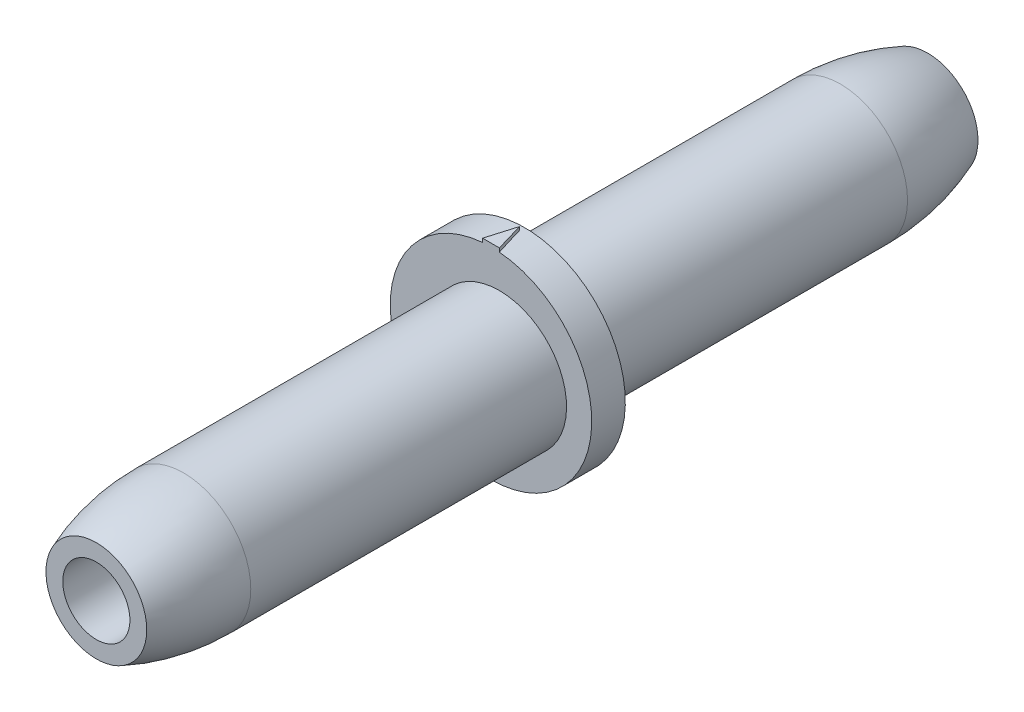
ISO-10303-21;
HEADER;
FILE_DESCRIPTION(('STEP AP214'),'2;1');
FILE_NAME('part.step','',(''),(''),'','','');
FILE_SCHEMA(('AUTOMOTIVE_DESIGN { 1 0 10303 214 1 1 1 1 }'));
ENDSEC;
DATA;
#1=APPLICATION_CONTEXT('core data for automotive mechanical design processes');
#2=APPLICATION_PROTOCOL_DEFINITION('international standard','automotive_design',2000,#1);
#3=PRODUCT_CONTEXT('',#1,'mechanical');
#4=PRODUCT('Part','Part','',(#3));
#5=PRODUCT_RELATED_PRODUCT_CATEGORY('part','',(#4));
#6=PRODUCT_DEFINITION_FORMATION('','',#4);
#7=PRODUCT_DEFINITION_CONTEXT('part definition',#1,'design');
#8=PRODUCT_DEFINITION('design','',#6,#7);
#9=PRODUCT_DEFINITION_SHAPE('','',#8);
#10=(LENGTH_UNIT() NAMED_UNIT(*) SI_UNIT(.MILLI.,.METRE.));
#11=(NAMED_UNIT(*) PLANE_ANGLE_UNIT() SI_UNIT($,.RADIAN.));
#12=(NAMED_UNIT(*) SI_UNIT($,.STERADIAN.) SOLID_ANGLE_UNIT());
#13=UNCERTAINTY_MEASURE_WITH_UNIT(LENGTH_MEASURE(1.E-05),#10,'distance_accuracy_value','');
#14=(GEOMETRIC_REPRESENTATION_CONTEXT(3) GLOBAL_UNCERTAINTY_ASSIGNED_CONTEXT((#13)) GLOBAL_UNIT_ASSIGNED_CONTEXT((#10,
#11,#12)) REPRESENTATION_CONTEXT('',''));
#15=CARTESIAN_POINT('',(0.,0.,0.));
#16=DIRECTION('',(0.,0.,1.));
#17=DIRECTION('',(1.,0.,0.));
#18=AXIS2_PLACEMENT_3D('',#15,#16,#17);
#19=CARTESIAN_POINT('',(8.29346026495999,3.0184723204,2.000000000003));
#20=DIRECTION('',(0.,3.58370213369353E-13,-1.));
#21=DIRECTION('',(-0.422618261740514,-0.906307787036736,-3.20665975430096E-13));
#22=AXIS2_PLACEMENT_3D('',#19,#20,#21);
#23=PLANE('',#22);
#24=CARTESIAN_POINT('',(0.5,0.,2.00000000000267));
#25=DIRECTION('',(0.,0.,-1.));
#26=DIRECTION('',(0.,1.,0.));
#27=AXIS2_PLACEMENT_3D('',#24,#25,#26);
#28=CIRCLE('',#27,2.);
#29=CARTESIAN_POINT('',(0.5,2.00000000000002,2.00000000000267));
#30=VERTEX_POINT('',#29);
#31=EDGE_CURVE('E18',#30,#30,#28,.T.);
#32=ORIENTED_EDGE('',*,*,#31,.F.);
#33=EDGE_LOOP('',(#32));
#34=FACE_BOUND('',#33,.T.);
#35=ADVANCED_FACE('F14',(#34),#23,.F.);
#36=CARTESIAN_POINT('',(0.5,0.,25.9999999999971));
#37=DIRECTION('',(0.,0.,-1.));
#38=DIRECTION('',(0.,1.,0.));
#39=AXIS2_PLACEMENT_3D('',#36,#37,#38);
#40=CYLINDRICAL_SURFACE('',#39,2.);
#41=CARTESIAN_POINT('',(0.5,0.,25.9999999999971));
#42=DIRECTION('',(0.,0.,-1.));
#43=DIRECTION('',(0.,1.,0.));
#44=AXIS2_PLACEMENT_3D('',#41,#42,#43);
#45=CIRCLE('',#44,2.);
#46=CARTESIAN_POINT('',(0.5,1.99999999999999,25.9999999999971));
#47=VERTEX_POINT('',#46);
#48=EDGE_CURVE('E102',#47,#47,#45,.T.);
#49=ORIENTED_EDGE('',*,*,#48,.F.);
#50=EDGE_LOOP('',(#49));
#51=FACE_BOUND('',#50,.T.);
#52=ORIENTED_EDGE('',*,*,#31,.T.);
#53=EDGE_LOOP('',(#52));
#54=FACE_BOUND('',#53,.T.);
#55=ADVANCED_FACE('F124',(#51,#54),#40,.F.);
#56=CARTESIAN_POINT('',(-2.62,3.12494455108,25.999999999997));
#57=DIRECTION('',(0.,0.,1.));
#58=DIRECTION('',(0.,-1.,0.));
#59=AXIS2_PLACEMENT_3D('',#56,#57,#58);
#60=PLANE('',#59);
#61=ORIENTED_EDGE('',*,*,#48,.T.);
#62=EDGE_LOOP('',(#61));
#63=FACE_BOUND('',#62,.T.);
#64=CARTESIAN_POINT('',(0.5,0.,25.999999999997));
#65=DIRECTION('',(0.,0.,-1.));
#66=DIRECTION('',(0.,1.,0.));
#67=AXIS2_PLACEMENT_3D('',#64,#65,#66);
#68=CIRCLE('',#67,3.00000000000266);
#69=CARTESIAN_POINT('',(0.5,3.00000000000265,25.999999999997));
#70=VERTEX_POINT('',#69);
#71=EDGE_CURVE('E100',#70,#70,#68,.F.);
#72=ORIENTED_EDGE('',*,*,#71,.T.);
#73=EDGE_LOOP('',(#72));
#74=FACE_BOUND('',#73,.T.);
#75=ADVANCED_FACE('F122',(#63,#74),#60,.T.);
#76=CARTESIAN_POINT('',(-9.5,0.,20.803847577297));
#77=DIRECTION('',(0.,1.,0.));
#78=DIRECTION('',(0.925721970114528,0.,0.378204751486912));
#79=AXIS2_PLACEMENT_3D('',#76,#77,#78);
#80=CIRCLE('',#79,14.);
#81=TRIMMED_CURVE('',#80,(PARAMETER_VALUE(-0.387337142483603)),
(PARAMETER_VALUE(1.16304960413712)),.T.,.PARAMETER.);
#82=CARTESIAN_POINT('',(0.5,0.,20.803847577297));
#83=DIRECTION('',(0.,0.,-1.));
#84=AXIS1_PLACEMENT('',#82,#83);
#85=SURFACE_OF_REVOLUTION('',#81,#84);
#86=ORIENTED_EDGE('',*,*,#71,.F.);
#87=EDGE_LOOP('',(#86));
#88=FACE_BOUND('',#87,.T.);
#89=CARTESIAN_POINT('',(0.5,0.,20.8038475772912));
#90=DIRECTION('',(0.,0.,-1.));
#91=DIRECTION('',(1.,0.,0.));
#92=AXIS2_PLACEMENT_3D('',#89,#90,#91);
#93=CIRCLE('',#92,4.);
#94=CARTESIAN_POINT('',(4.5,0.,20.8038475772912));
#95=VERTEX_POINT('',#94);
#96=EDGE_CURVE('E61',#95,#95,#93,.F.);
#97=ORIENTED_EDGE('',*,*,#96,.T.);
#98=EDGE_LOOP('',(#97));
#99=FACE_BOUND('',#98,.T.);
#100=ADVANCED_FACE('F118',(#88,#99),#85,.T.);
#101=CARTESIAN_POINT('',(0.523832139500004,6.20000000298,2.248109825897));
#102=DIRECTION('',(0.,1.,0.));
#103=DIRECTION('',(0.173648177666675,0.,-0.984807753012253));
#104=AXIS2_PLACEMENT_3D('',#101,#102,#103);
#105=PLANE('',#104);
#106=DIRECTION('',(0.28216631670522,0.,0.959365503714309));
#107=VECTOR('',#106,1.);
#108=CARTESIAN_POINT('',(0.25,6.20000000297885,1.1499999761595));
#109=LINE('',#108,#107);
#110=CARTESIAN_POINT('',(-6.03683769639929E-13,6.20000000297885,0.299999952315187));
#111=VERTEX_POINT('',#110);
#112=CARTESIAN_POINT('',(0.4999999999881,6.20000000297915,1.99999999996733));
#113=VERTEX_POINT('',#112);
#114=EDGE_CURVE('E52',#111,#113,#109,.T.);
#115=ORIENTED_EDGE('',*,*,#114,.F.);
#116=DIRECTION('',(-0.282166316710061,0.,0.959365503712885));
#117=VECTOR('',#116,1.);
#118=CARTESIAN_POINT('',(-0.250000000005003,6.20000000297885,1.1499999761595));
#119=LINE('',#118,#117);
#120=CARTESIAN_POINT('',(-0.500000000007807,6.20000000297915,2.00000000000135));
#121=VERTEX_POINT('',#120);
#122=EDGE_CURVE('E56',#111,#121,#119,.T.);
#123=ORIENTED_EDGE('',*,*,#122,.T.);
#124=DIRECTION('',(1.,0.,-3.24393290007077E-13));
#125=VECTOR('',#124,1.);
#126=CARTESIAN_POINT('',(-0.500000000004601,6.20000000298,1.9999999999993));
#127=LINE('',#126,#125);
#128=EDGE_CURVE('E46',#121,#113,#127,.T.);
#129=ORIENTED_EDGE('',*,*,#128,.T.);
#130=EDGE_LOOP('',(#115,#123,#129));
#131=FACE_BOUND('',#130,.T.);
#132=ADVANCED_FACE('F54',(#131),#105,.T.);
#133=CARTESIAN_POINT('',(0.5,0.,20.8038475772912));
#134=DIRECTION('',(0.,0.,-1.));
#135=DIRECTION('',(0.,1.,0.));
#136=AXIS2_PLACEMENT_3D('',#133,#134,#135);
#137=CYLINDRICAL_SURFACE('',#136,4.);
#138=ORIENTED_EDGE('',*,*,#96,.F.);
#139=EDGE_LOOP('',(#138));
#140=FACE_BOUND('',#139,.T.);
#141=CARTESIAN_POINT('',(0.5,0.,2.00000000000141));
#142=DIRECTION('',(0.,0.,-1.));
#143=DIRECTION('',(0.,1.,0.));
#144=AXIS2_PLACEMENT_3D('',#141,#142,#143);
#145=CIRCLE('',#144,4.);
#146=CARTESIAN_POINT('',(0.5,4.,2.00000000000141));
#147=VERTEX_POINT('',#146);
#148=EDGE_CURVE('E95',#147,#147,#145,.F.);
#149=ORIENTED_EDGE('',*,*,#148,.T.);
#150=EDGE_LOOP('',(#149));
#151=FACE_BOUND('',#150,.T.);
#152=ADVANCED_FACE('F125',(#140,#151),#137,.T.);
#153=CARTESIAN_POINT('',(0.518779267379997,6.26655389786,2.063849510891));
#154=DIRECTION('',(0.959365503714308,0.,-0.282166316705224));
#155=DIRECTION('',(0.,-1.,0.));
#156=AXIS2_PLACEMENT_3D('',#153,#154,#155);
#157=PLANE('',#156);
#158=ORIENTED_EDGE('',*,*,#114,.T.);
#159=DIRECTION('',(0.,-1.,0.));
#160=VECTOR('',#159,1.);
#161=CARTESIAN_POINT('',(0.499999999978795,6.26655389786,1.99999999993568));
#162=LINE('',#161,#160);
#163=CARTESIAN_POINT('',(0.499999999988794,5.9791471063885,1.99999999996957));
#164=VERTEX_POINT('',#163);
#165=EDGE_CURVE('E71',#113,#164,#162,.T.);
#166=ORIENTED_EDGE('',*,*,#165,.T.);
#167=CARTESIAN_POINT('',(0.000100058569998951,7.76058300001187E-05,0.30034015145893));
#168=DIRECTION('',(0.959365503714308,0.,-0.282166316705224));
#169=DIRECTION('',(0.282166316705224,0.,0.959365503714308));
#170=AXIS2_PLACEMENT_3D('',#167,#168,#169);
#171=ELLIPSE('',#170,21.2638102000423,5.99993100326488);
#172=CARTESIAN_POINT('',(-8.04911692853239E-13,6.00000860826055,0.299999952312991));
#173=VERTEX_POINT('',#172);
#174=EDGE_CURVE('E65',#164,#173,#171,.F.);
#175=ORIENTED_EDGE('',*,*,#174,.T.);
#176=DIRECTION('',(0.,1.,0.));
#177=VECTOR('',#176,1.);
#178=CARTESIAN_POINT('',(-1.50573997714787E-12,6.089565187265,0.299999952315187));
#179=LINE('',#178,#177);
#180=EDGE_CURVE('E60',#173,#111,#179,.T.);
#181=ORIENTED_EDGE('',*,*,#180,.T.);
#182=EDGE_LOOP('',(#158,#166,#175,#181));
#183=FACE_BOUND('',#182,.T.);
#184=ADVANCED_FACE('F64',(#183),#157,.T.);
#185=CARTESIAN_POINT('',(0.0187792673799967,5.91257647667,0.236150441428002));
#186=DIRECTION('',(0.959365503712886,0.,0.282166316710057));
#187=DIRECTION('',(0.,1.,0.));
#188=AXIS2_PLACEMENT_3D('',#185,#186,#187);
#189=PLANE('',#188);
#190=ORIENTED_EDGE('',*,*,#122,.F.);
#191=ORIENTED_EDGE('',*,*,#180,.F.);
#192=CARTESIAN_POINT('',(0.000100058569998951,7.76058300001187E-05,0.299659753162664));
#193=DIRECTION('',(0.959365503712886,0.,0.282166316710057));
#194=DIRECTION('',(-0.282166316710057,0.,0.959365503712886));
#195=AXIS2_PLACEMENT_3D('',#192,#193,#194);
#196=ELLIPSE('',#195,21.2638101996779,5.99993100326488);
#197=CARTESIAN_POINT('',(-0.500000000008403,5.9791303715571,2.00000000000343));
#198=VERTEX_POINT('',#197);
#199=EDGE_CURVE('E89',#173,#198,#196,.T.);
#200=ORIENTED_EDGE('',*,*,#199,.T.);
#201=DIRECTION('',(0.,1.,0.));
#202=VECTOR('',#201,1.);
#203=CARTESIAN_POINT('',(-0.500000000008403,5.91257647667,2.0000000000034));
#204=LINE('',#203,#202);
#205=EDGE_CURVE('E69',#198,#121,#204,.T.);
#206=ORIENTED_EDGE('',*,*,#205,.T.);
#207=EDGE_LOOP('',(#190,#191,#200,#206));
#208=FACE_BOUND('',#207,.T.);
#209=ADVANCED_FACE('F68',(#208),#189,.F.);
#210=CARTESIAN_POINT('',(8.29346026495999,3.0184723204,2.000000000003));
#211=DIRECTION('',(0.,3.58370213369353E-13,-1.));
#212=DIRECTION('',(-0.422618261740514,-0.906307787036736,-3.20665975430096E-13));
#213=AXIS2_PLACEMENT_3D('',#210,#211,#212);
#214=PLANE('',#213);
#215=ORIENTED_EDGE('',*,*,#148,.F.);
#216=EDGE_LOOP('',(#215));
#217=FACE_BOUND('',#216,.T.);
#218=ORIENTED_EDGE('',*,*,#205,.F.);
#219=CARTESIAN_POINT('',(0.000100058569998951,7.76058299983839E-05,2.00000000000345));
#220=DIRECTION('',(0.,0.,1.));
#221=DIRECTION('',(0.,-1.,0.));
#222=AXIS2_PLACEMENT_3D('',#219,#220,#221);
#223=CIRCLE('',#222,5.99993100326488);
#224=EDGE_CURVE('E33',#198,#164,#223,.T.);
#225=ORIENTED_EDGE('',*,*,#224,.T.);
#226=ORIENTED_EDGE('',*,*,#165,.F.);
#227=ORIENTED_EDGE('',*,*,#128,.F.);
#228=EDGE_LOOP('',(#218,#225,#226,#227));
#229=FACE_BOUND('',#228,.T.);
#230=ADVANCED_FACE('F138',(#217,#229),#214,.F.);
#231=CARTESIAN_POINT('',(0.000100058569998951,7.76058300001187E-05,1.45022882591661E-12));
#232=DIRECTION('',(0.,0.,1.));
#233=DIRECTION('',(0.,-1.,0.));
#234=AXIS2_PLACEMENT_3D('',#231,#232,#233);
#235=CYLINDRICAL_SURFACE('',#234,5.99993100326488);
#236=CARTESIAN_POINT('',(0.000100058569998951,7.76058300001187E-05,1.45022882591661E-12));
#237=DIRECTION('',(0.,0.,1.));
#238=DIRECTION('',(0.,-1.,0.));
#239=AXIS2_PLACEMENT_3D('',#236,#237,#238);
#240=CIRCLE('',#239,5.99993100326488);
#241=CARTESIAN_POINT('',(0.000100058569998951,-5.99985339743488,1.44877651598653E-12));
#242=VERTEX_POINT('',#241);
#243=EDGE_CURVE('E82',#242,#242,#240,.F.);
#244=ORIENTED_EDGE('',*,*,#243,.F.);
#245=EDGE_LOOP('',(#244));
#246=FACE_BOUND('',#245,.T.);
#247=ORIENTED_EDGE('',*,*,#224,.F.);
#248=ORIENTED_EDGE('',*,*,#199,.F.);
#249=ORIENTED_EDGE('',*,*,#174,.F.);
#250=EDGE_LOOP('',(#247,#248,#249));
#251=FACE_BOUND('',#250,.T.);
#252=ADVANCED_FACE('F135',(#246,#251),#235,.T.);
#253=CARTESIAN_POINT('',(8.82469120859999,7.76058300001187E-05,0.));
#254=DIRECTION('',(0.,3.40224292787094E-13,-1.));
#255=DIRECTION('',(-0.707106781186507,-0.707106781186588,-2.40574904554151E-13));
#256=AXIS2_PLACEMENT_3D('',#253,#254,#255);
#257=PLANE('',#256);
#258=ORIENTED_EDGE('',*,*,#243,.T.);
#259=EDGE_LOOP('',(#258));
#260=FACE_BOUND('',#259,.T.);
#261=CARTESIAN_POINT('',(0.,0.,0.));
#262=DIRECTION('',(0.,3.40224292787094E-13,-1.));
#263=DIRECTION('',(0.,1.,3.40224292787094E-13));
#264=AXIS2_PLACEMENT_3D('',#261,#262,#263);
#265=CIRCLE('',#264,4.);
#266=CARTESIAN_POINT('',(0.,4.,1.36089717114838E-12));
#267=VERTEX_POINT('',#266);
#268=EDGE_CURVE('E107',#267,#267,#265,.F.);
#269=ORIENTED_EDGE('',*,*,#268,.T.);
#270=EDGE_LOOP('',(#269));
#271=FACE_BOUND('',#270,.T.);
#272=ADVANCED_FACE('F16',(#260,#271),#257,.T.);
#273=CARTESIAN_POINT('',(2.08,-2.07072019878,-2.500000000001));
#274=DIRECTION('',(0.,0.,1.));
#275=DIRECTION('',(0.,1.,0.));
#276=AXIS2_PLACEMENT_3D('',#273,#274,#275);
#277=PLANE('',#276);
#278=CARTESIAN_POINT('',(0.,0.,-2.50000000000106));
#279=DIRECTION('',(0.,0.,-1.));
#280=DIRECTION('',(0.,1.,0.));
#281=AXIS2_PLACEMENT_3D('',#278,#279,#280);
#282=CIRCLE('',#281,2.);
#283=CARTESIAN_POINT('',(0.,2.,-2.50000000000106));
#284=VERTEX_POINT('',#283);
#285=EDGE_CURVE('E92',#284,#284,#282,.F.);
#286=ORIENTED_EDGE('',*,*,#285,.F.);
#287=EDGE_LOOP('',(#286));
#288=FACE_BOUND('',#287,.T.);
#289=ADVANCED_FACE('F133',(#288),#277,.F.);
#290=CARTESIAN_POINT('',(0.,0.,-2.50000000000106));
#291=DIRECTION('',(0.,0.,-1.));
#292=DIRECTION('',(0.,1.,0.));
#293=AXIS2_PLACEMENT_3D('',#290,#291,#292);
#294=CYLINDRICAL_SURFACE('',#293,2.);
#295=CARTESIAN_POINT('',(0.,0.,-24.0000000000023));
#296=DIRECTION('',(0.,0.,-1.));
#297=DIRECTION('',(0.,1.,0.));
#298=AXIS2_PLACEMENT_3D('',#295,#296,#297);
#299=CIRCLE('',#298,2.);
#300=CARTESIAN_POINT('',(0.,2.00000000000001,-24.0000000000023));
#301=VERTEX_POINT('',#300);
#302=EDGE_CURVE('E85',#301,#301,#299,.T.);
#303=ORIENTED_EDGE('',*,*,#302,.T.);
#304=EDGE_LOOP('',(#303));
#305=FACE_BOUND('',#304,.T.);
#306=ORIENTED_EDGE('',*,*,#285,.T.);
#307=EDGE_LOOP('',(#306));
#308=FACE_BOUND('',#307,.T.);
#309=ADVANCED_FACE('F129',(#305,#308),#294,.F.);
#310=CARTESIAN_POINT('',(3.12,-3.07130805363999,-24.000000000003));
#311=DIRECTION('',(0.,0.,1.));
#312=DIRECTION('',(0.,1.,0.));
#313=AXIS2_PLACEMENT_3D('',#310,#311,#312);
#314=PLANE('',#313);
#315=CARTESIAN_POINT('',(0.,0.,-24.000000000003));
#316=DIRECTION('',(0.,0.,-1.));
#317=DIRECTION('',(0.,1.,0.));
#318=AXIS2_PLACEMENT_3D('',#315,#316,#317);
#319=CIRCLE('',#318,2.99999999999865);
#320=CARTESIAN_POINT('',(0.,2.99999999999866,-24.000000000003));
#321=VERTEX_POINT('',#320);
#322=EDGE_CURVE('E24',#321,#321,#319,.T.);
#323=ORIENTED_EDGE('',*,*,#322,.T.);
#324=EDGE_LOOP('',(#323));
#325=FACE_BOUND('',#324,.T.);
#326=ORIENTED_EDGE('',*,*,#302,.F.);
#327=EDGE_LOOP('',(#326));
#328=FACE_BOUND('',#327,.T.);
#329=ADVANCED_FACE('F132',(#325,#328),#314,.F.);
#330=CARTESIAN_POINT('',(-10.,0.,-18.803847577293));
#331=DIRECTION('',(0.,1.,0.));
#332=DIRECTION('',(0.999971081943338,0.,0.00760495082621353));
#333=AXIS2_PLACEMENT_3D('',#330,#331,#332);
#334=CIRCLE('',#333,14.);
#335=TRIMMED_CURVE('',#334,(PARAMETER_VALUE(-0.7675883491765)),
(PARAMETER_VALUE(0.782798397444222)),.T.,.PARAMETER.);
#336=CARTESIAN_POINT('',(0.,0.,-18.803847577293));
#337=DIRECTION('',(0.,0.,-1.));
#338=AXIS1_PLACEMENT('',#336,#337);
#339=SURFACE_OF_REVOLUTION('',#335,#338);
#340=ORIENTED_EDGE('',*,*,#322,.F.);
#341=EDGE_LOOP('',(#340));
#342=FACE_BOUND('',#341,.T.);
#343=CARTESIAN_POINT('',(0.,0.,-18.8038475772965));
#344=DIRECTION('',(0.,0.,-1.));
#345=DIRECTION('',(1.,0.,0.));
#346=AXIS2_PLACEMENT_3D('',#343,#344,#345);
#347=CIRCLE('',#346,4.);
#348=CARTESIAN_POINT('',(4.,0.,-18.8038475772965));
#349=VERTEX_POINT('',#348);
#350=EDGE_CURVE('E9',#349,#349,#347,.T.);
#351=ORIENTED_EDGE('',*,*,#350,.T.);
#352=EDGE_LOOP('',(#351));
#353=FACE_BOUND('',#352,.T.);
#354=ADVANCED_FACE('F140',(#342,#353),#339,.T.);
#355=CARTESIAN_POINT('',(0.,0.,-2.50000000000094));
#356=DIRECTION('',(0.,0.,-1.));
#357=DIRECTION('',(0.,1.,0.));
#358=AXIS2_PLACEMENT_3D('',#355,#356,#357);
#359=CYLINDRICAL_SURFACE('',#358,4.);
#360=ORIENTED_EDGE('',*,*,#350,.F.);
#361=EDGE_LOOP('',(#360));
#362=FACE_BOUND('',#361,.T.);
#363=ORIENTED_EDGE('',*,*,#268,.F.);
#364=EDGE_LOOP('',(#363));
#365=FACE_BOUND('',#364,.T.);
#366=ADVANCED_FACE('F144',(#362,#365),#359,.T.);
#367=CLOSED_SHELL('',(#35,#55,#75,#100,#132,#152,#184,#209,#230,#252,#272,#289,#309,#329,#354,#366));
#368=MANIFOLD_SOLID_BREP('B1',#367);
#369=ADVANCED_BREP_SHAPE_REPRESENTATION('',(#18,#368),#14);
#370=SHAPE_DEFINITION_REPRESENTATION(#9,#369);
ENDSEC;
END-ISO-10303-21;
